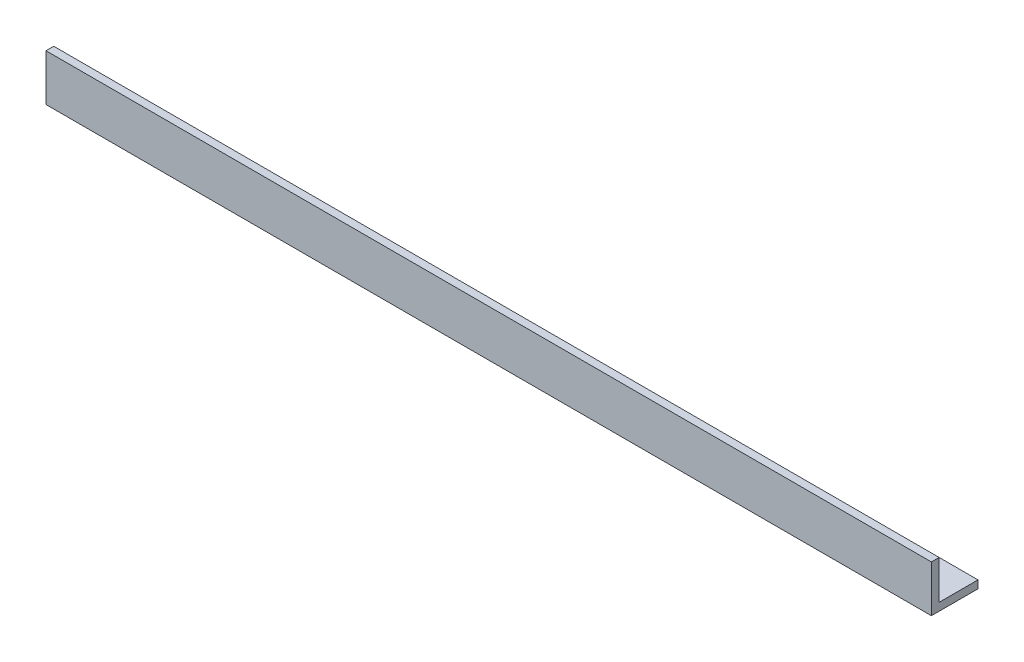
from build123d import *

# Parameters (mm, degrees)
BOSS_EXTRUDE1_DEPTH = 723.9


with BuildPart() as part:
    # Sketch1 → Boss-Extrude1 (new body)
    with BuildSketch(Plane(origin=(0, 0, 0), x_dir=(0, 0, -1), z_dir=(1, 0, 0))):
        Polygon((0, 0), (0, 38.1), (6.35, 38.1), (6.35, 6.35), (38.1, 6.35), (38.1, 0), align=None)
    extrude(amount=BOSS_EXTRUDE1_DEPTH)


solid = part.part
